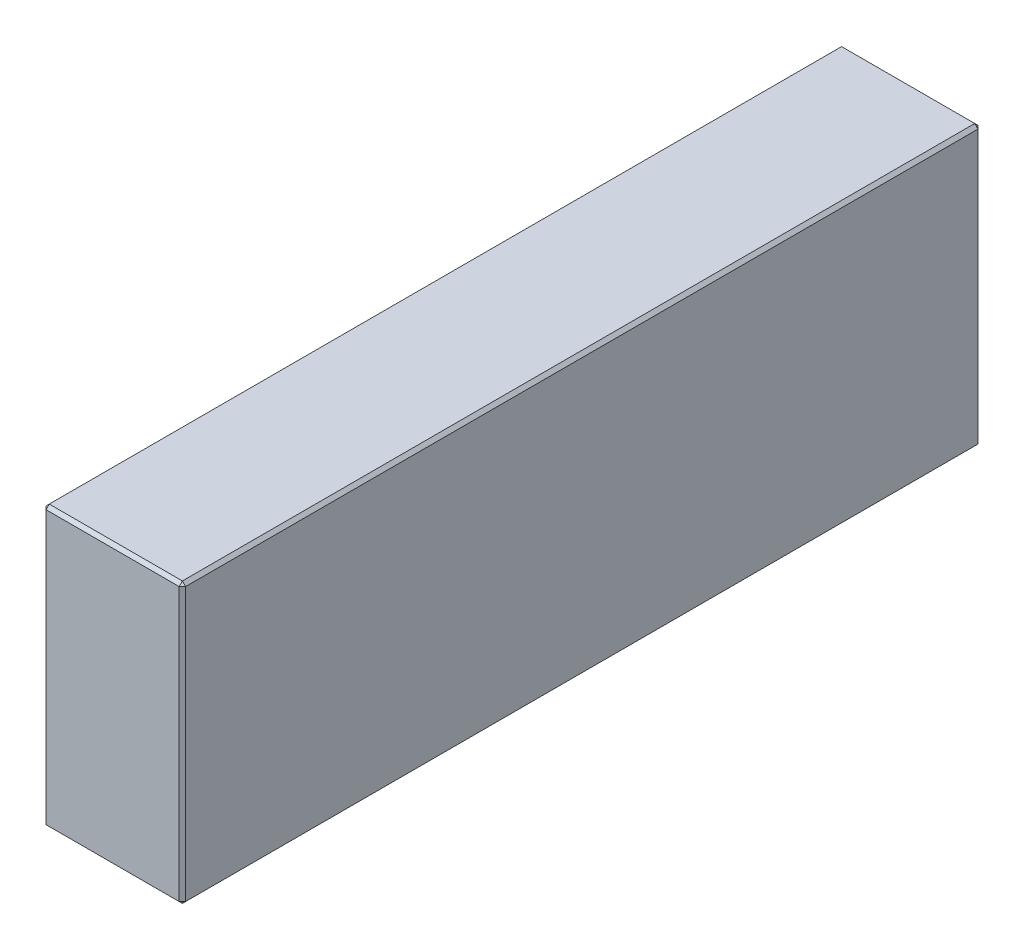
ISO-10303-21;
HEADER;
FILE_DESCRIPTION(('STEP AP214'),'2;1');
FILE_NAME('part.step','',(''),(''),'','','');
FILE_SCHEMA(('AUTOMOTIVE_DESIGN { 1 0 10303 214 1 1 1 1 }'));
ENDSEC;
DATA;
#1=APPLICATION_CONTEXT('core data for automotive mechanical design processes');
#2=APPLICATION_PROTOCOL_DEFINITION('international standard','automotive_design',2000,#1);
#3=PRODUCT_CONTEXT('',#1,'mechanical');
#4=PRODUCT('Part','Part','',(#3));
#5=PRODUCT_RELATED_PRODUCT_CATEGORY('part','',(#4));
#6=PRODUCT_DEFINITION_FORMATION('','',#4);
#7=PRODUCT_DEFINITION_CONTEXT('part definition',#1,'design');
#8=PRODUCT_DEFINITION('design','',#6,#7);
#9=PRODUCT_DEFINITION_SHAPE('','',#8);
#10=(LENGTH_UNIT() NAMED_UNIT(*) SI_UNIT(.MILLI.,.METRE.));
#11=(NAMED_UNIT(*) PLANE_ANGLE_UNIT() SI_UNIT($,.RADIAN.));
#12=(NAMED_UNIT(*) SI_UNIT($,.STERADIAN.) SOLID_ANGLE_UNIT());
#13=UNCERTAINTY_MEASURE_WITH_UNIT(LENGTH_MEASURE(1.E-05),#10,'distance_accuracy_value','');
#14=(GEOMETRIC_REPRESENTATION_CONTEXT(3) GLOBAL_UNCERTAINTY_ASSIGNED_CONTEXT((#13)) GLOBAL_UNIT_ASSIGNED_CONTEXT((#10,
#11,#12)) REPRESENTATION_CONTEXT('',''));
#15=CARTESIAN_POINT('',(0.,0.,0.));
#16=DIRECTION('',(0.,0.,1.));
#17=DIRECTION('',(1.,0.,0.));
#18=AXIS2_PLACEMENT_3D('',#15,#16,#17);
#19=CARTESIAN_POINT('',(-21.5,86.,123.));
#20=DIRECTION('',(1.,0.,0.));
#21=DIRECTION('',(0.,0.,-1.));
#22=AXIS2_PLACEMENT_3D('',#19,#20,#21);
#23=PLANE('',#22);
#24=DIRECTION('',(0.,-1.,0.));
#25=VECTOR('',#24,1.);
#26=CARTESIAN_POINT('',(-21.5,86.,-122.));
#27=LINE('',#26,#25);
#28=CARTESIAN_POINT('',(-21.5,85.,-122.));
#29=VERTEX_POINT('',#28);
#30=CARTESIAN_POINT('',(-21.5,1.,-122.));
#31=VERTEX_POINT('',#30);
#32=EDGE_CURVE('E115',#29,#31,#27,.T.);
#33=ORIENTED_EDGE('',*,*,#32,.T.);
#34=DIRECTION('',(0.,0.,1.));
#35=VECTOR('',#34,1.);
#36=CARTESIAN_POINT('',(-21.5,1.,123.));
#37=LINE('',#36,#35);
#38=CARTESIAN_POINT('',(-21.5,1.,122.));
#39=VERTEX_POINT('',#38);
#40=EDGE_CURVE('E111',#31,#39,#37,.T.);
#41=ORIENTED_EDGE('',*,*,#40,.T.);
#42=DIRECTION('',(0.,1.,0.));
#43=VECTOR('',#42,1.);
#44=CARTESIAN_POINT('',(-21.5,86.,122.));
#45=LINE('',#44,#43);
#46=CARTESIAN_POINT('',(-21.5,85.,122.));
#47=VERTEX_POINT('',#46);
#48=EDGE_CURVE('E104',#39,#47,#45,.T.);
#49=ORIENTED_EDGE('',*,*,#48,.T.);
#50=DIRECTION('',(0.,0.,-1.));
#51=VECTOR('',#50,1.);
#52=CARTESIAN_POINT('',(-21.5,85.,-123.));
#53=LINE('',#52,#51);
#54=EDGE_CURVE('E108',#47,#29,#53,.T.);
#55=ORIENTED_EDGE('',*,*,#54,.T.);
#56=EDGE_LOOP('',(#33,#41,#49,#55));
#57=FACE_BOUND('',#56,.T.);
#58=ADVANCED_FACE('F16',(#57),#23,.F.);
#59=CARTESIAN_POINT('',(21.5,86.,123.));
#60=DIRECTION('',(0.,0.,-1.));
#61=DIRECTION('',(-1.,0.,0.));
#62=AXIS2_PLACEMENT_3D('',#59,#60,#61);
#63=PLANE('',#62);
#64=DIRECTION('',(-1.,0.,0.));
#65=VECTOR('',#64,1.);
#66=CARTESIAN_POINT('',(-21.5,85.,123.));
#67=LINE('',#66,#65);
#68=CARTESIAN_POINT('',(20.5,85.,123.));
#69=VERTEX_POINT('',#68);
#70=CARTESIAN_POINT('',(-20.5,85.,123.));
#71=VERTEX_POINT('',#70);
#72=EDGE_CURVE('E165',#69,#71,#67,.T.);
#73=ORIENTED_EDGE('',*,*,#72,.T.);
#74=DIRECTION('',(0.,-1.,0.));
#75=VECTOR('',#74,1.);
#76=CARTESIAN_POINT('',(-20.5,86.,123.));
#77=LINE('',#76,#75);
#78=CARTESIAN_POINT('',(-20.5,0.999999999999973,123.));
#79=VERTEX_POINT('',#78);
#80=EDGE_CURVE('E123',#71,#79,#77,.T.);
#81=ORIENTED_EDGE('',*,*,#80,.T.);
#82=DIRECTION('',(1.,0.,0.));
#83=VECTOR('',#82,1.);
#84=CARTESIAN_POINT('',(21.5,0.999999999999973,123.));
#85=LINE('',#84,#83);
#86=CARTESIAN_POINT('',(20.5,0.999999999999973,123.));
#87=VERTEX_POINT('',#86);
#88=EDGE_CURVE('E169',#79,#87,#85,.T.);
#89=ORIENTED_EDGE('',*,*,#88,.T.);
#90=DIRECTION('',(0.,1.,0.));
#91=VECTOR('',#90,1.);
#92=CARTESIAN_POINT('',(20.5,86.,123.));
#93=LINE('',#92,#91);
#94=EDGE_CURVE('E167',#87,#69,#93,.T.);
#95=ORIENTED_EDGE('',*,*,#94,.T.);
#96=EDGE_LOOP('',(#73,#81,#89,#95));
#97=FACE_BOUND('',#96,.T.);
#98=ADVANCED_FACE('F276',(#97),#63,.F.);
#99=CARTESIAN_POINT('',(21.5,86.,123.));
#100=DIRECTION('',(-1.,0.,0.));
#101=DIRECTION('',(0.,0.,1.));
#102=AXIS2_PLACEMENT_3D('',#99,#100,#101);
#103=PLANE('',#102);
#104=DIRECTION('',(0.,0.,-1.));
#105=VECTOR('',#104,1.);
#106=CARTESIAN_POINT('',(21.5,0.999999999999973,123.));
#107=LINE('',#106,#105);
#108=CARTESIAN_POINT('',(21.5,0.999999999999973,122.));
#109=VERTEX_POINT('',#108);
#110=CARTESIAN_POINT('',(21.5,0.999999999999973,-122.));
#111=VERTEX_POINT('',#110);
#112=EDGE_CURVE('E160',#109,#111,#107,.T.);
#113=ORIENTED_EDGE('',*,*,#112,.T.);
#114=DIRECTION('',(0.,1.,0.));
#115=VECTOR('',#114,1.);
#116=CARTESIAN_POINT('',(21.5,86.,-122.));
#117=LINE('',#116,#115);
#118=CARTESIAN_POINT('',(21.5,85.,-122.));
#119=VERTEX_POINT('',#118);
#120=EDGE_CURVE('E162',#111,#119,#117,.T.);
#121=ORIENTED_EDGE('',*,*,#120,.T.);
#122=DIRECTION('',(0.,0.,1.));
#123=VECTOR('',#122,1.);
#124=CARTESIAN_POINT('',(21.5,85.,123.));
#125=LINE('',#124,#123);
#126=CARTESIAN_POINT('',(21.5,85.,122.));
#127=VERTEX_POINT('',#126);
#128=EDGE_CURVE('E156',#119,#127,#125,.T.);
#129=ORIENTED_EDGE('',*,*,#128,.T.);
#130=DIRECTION('',(0.,-1.,0.));
#131=VECTOR('',#130,1.);
#132=CARTESIAN_POINT('',(21.5,86.,122.));
#133=LINE('',#132,#131);
#134=EDGE_CURVE('E158',#127,#109,#133,.T.);
#135=ORIENTED_EDGE('',*,*,#134,.T.);
#136=EDGE_LOOP('',(#113,#121,#129,#135));
#137=FACE_BOUND('',#136,.T.);
#138=ADVANCED_FACE('F255',(#137),#103,.F.);
#139=CARTESIAN_POINT('',(21.5,86.,-123.));
#140=DIRECTION('',(0.,0.,1.));
#141=DIRECTION('',(1.,0.,0.));
#142=AXIS2_PLACEMENT_3D('',#139,#140,#141);
#143=PLANE('',#142);
#144=DIRECTION('',(0.,-1.,0.));
#145=VECTOR('',#144,1.);
#146=CARTESIAN_POINT('',(20.5,86.,-123.));
#147=LINE('',#146,#145);
#148=CARTESIAN_POINT('',(20.5,85.,-123.));
#149=VERTEX_POINT('',#148);
#150=CARTESIAN_POINT('',(20.5,0.999999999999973,-123.));
#151=VERTEX_POINT('',#150);
#152=EDGE_CURVE('E149',#149,#151,#147,.T.);
#153=ORIENTED_EDGE('',*,*,#152,.T.);
#154=DIRECTION('',(-1.,0.,0.));
#155=VECTOR('',#154,1.);
#156=CARTESIAN_POINT('',(21.5,0.999999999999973,-123.));
#157=LINE('',#156,#155);
#158=CARTESIAN_POINT('',(-20.5,0.999999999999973,-123.));
#159=VERTEX_POINT('',#158);
#160=EDGE_CURVE('E154',#151,#159,#157,.T.);
#161=ORIENTED_EDGE('',*,*,#160,.T.);
#162=DIRECTION('',(0.,1.,0.));
#163=VECTOR('',#162,1.);
#164=CARTESIAN_POINT('',(-20.5,86.,-123.));
#165=LINE('',#164,#163);
#166=CARTESIAN_POINT('',(-20.5,85.,-123.));
#167=VERTEX_POINT('',#166);
#168=EDGE_CURVE('E151',#159,#167,#165,.T.);
#169=ORIENTED_EDGE('',*,*,#168,.T.);
#170=DIRECTION('',(1.,0.,0.));
#171=VECTOR('',#170,1.);
#172=CARTESIAN_POINT('',(21.5,85.,-123.));
#173=LINE('',#172,#171);
#174=EDGE_CURVE('E147',#167,#149,#173,.T.);
#175=ORIENTED_EDGE('',*,*,#174,.T.);
#176=EDGE_LOOP('',(#153,#161,#169,#175));
#177=FACE_BOUND('',#176,.T.);
#178=ADVANCED_FACE('F285',(#177),#143,.F.);
#179=CARTESIAN_POINT('',(0.,86.,0.));
#180=DIRECTION('',(0.,1.,0.));
#181=DIRECTION('',(0.,0.,1.));
#182=AXIS2_PLACEMENT_3D('',#179,#180,#181);
#183=PLANE('',#182);
#184=DIRECTION('',(0.,0.,-1.));
#185=VECTOR('',#184,1.);
#186=CARTESIAN_POINT('',(20.5,86.,-123.));
#187=LINE('',#186,#185);
#188=CARTESIAN_POINT('',(20.5,86.,122.));
#189=VERTEX_POINT('',#188);
#190=CARTESIAN_POINT('',(20.5,86.,-122.));
#191=VERTEX_POINT('',#190);
#192=EDGE_CURVE('E25',#189,#191,#187,.T.);
#193=ORIENTED_EDGE('',*,*,#192,.T.);
#194=DIRECTION('',(-1.,0.,0.));
#195=VECTOR('',#194,1.);
#196=CARTESIAN_POINT('',(-21.5,86.,-122.));
#197=LINE('',#196,#195);
#198=CARTESIAN_POINT('',(-20.5,86.,-122.));
#199=VERTEX_POINT('',#198);
#200=EDGE_CURVE('E10',#191,#199,#197,.T.);
#201=ORIENTED_EDGE('',*,*,#200,.T.);
#202=DIRECTION('',(0.,0.,1.));
#203=VECTOR('',#202,1.);
#204=CARTESIAN_POINT('',(-20.5,86.,123.));
#205=LINE('',#204,#203);
#206=CARTESIAN_POINT('',(-20.5,86.,122.));
#207=VERTEX_POINT('',#206);
#208=EDGE_CURVE('E181',#199,#207,#205,.T.);
#209=ORIENTED_EDGE('',*,*,#208,.T.);
#210=DIRECTION('',(1.,0.,0.));
#211=VECTOR('',#210,1.);
#212=CARTESIAN_POINT('',(21.5,86.,122.));
#213=LINE('',#212,#211);
#214=EDGE_CURVE('E36',#207,#189,#213,.T.);
#215=ORIENTED_EDGE('',*,*,#214,.T.);
#216=EDGE_LOOP('',(#193,#201,#209,#215));
#217=FACE_BOUND('',#216,.T.);
#218=ADVANCED_FACE('F351',(#217),#183,.T.);
#219=CARTESIAN_POINT('',(0.,0.,0.));
#220=DIRECTION('',(0.,1.,0.));
#221=DIRECTION('',(0.,0.,1.));
#222=AXIS2_PLACEMENT_3D('',#219,#220,#221);
#223=PLANE('',#222);
#224=DIRECTION('',(0.,0.,1.));
#225=VECTOR('',#224,1.);
#226=CARTESIAN_POINT('',(20.5,0.,0.));
#227=LINE('',#226,#225);
#228=CARTESIAN_POINT('',(20.5,0.,-122.));
#229=VERTEX_POINT('',#228);
#230=CARTESIAN_POINT('',(20.5,0.,122.));
#231=VERTEX_POINT('',#230);
#232=EDGE_CURVE('E172',#229,#231,#227,.T.);
#233=ORIENTED_EDGE('',*,*,#232,.T.);
#234=DIRECTION('',(-1.,0.,0.));
#235=VECTOR('',#234,1.);
#236=CARTESIAN_POINT('',(0.,0.,122.));
#237=LINE('',#236,#235);
#238=CARTESIAN_POINT('',(-20.5,0.,122.));
#239=VERTEX_POINT('',#238);
#240=EDGE_CURVE('E178',#231,#239,#237,.T.);
#241=ORIENTED_EDGE('',*,*,#240,.T.);
#242=DIRECTION('',(0.,0.,-1.));
#243=VECTOR('',#242,1.);
#244=CARTESIAN_POINT('',(-20.5,0.,0.));
#245=LINE('',#244,#243);
#246=CARTESIAN_POINT('',(-20.5,0.,-122.));
#247=VERTEX_POINT('',#246);
#248=EDGE_CURVE('E176',#239,#247,#245,.T.);
#249=ORIENTED_EDGE('',*,*,#248,.T.);
#250=DIRECTION('',(1.,0.,0.));
#251=VECTOR('',#250,1.);
#252=CARTESIAN_POINT('',(0.,0.,-122.));
#253=LINE('',#252,#251);
#254=EDGE_CURVE('E174',#247,#229,#253,.T.);
#255=ORIENTED_EDGE('',*,*,#254,.T.);
#256=EDGE_LOOP('',(#233,#241,#249,#255));
#257=FACE_BOUND('',#256,.T.);
#258=ADVANCED_FACE('F247',(#257),#223,.F.);
#259=CARTESIAN_POINT('',(21.5,86.,122.));
#260=DIRECTION('',(-0.707106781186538,0.,-0.707106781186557));
#261=DIRECTION('',(0.,-1.,0.));
#262=AXIS2_PLACEMENT_3D('',#259,#260,#261);
#263=PLANE('',#262);
#264=DIRECTION('',(-0.707106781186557,0.,0.707106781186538));
#265=VECTOR('',#264,1.);
#266=CARTESIAN_POINT('',(20.5,85.,123.));
#267=LINE('',#266,#265);
#268=EDGE_CURVE('E20',#69,#127,#267,.F.);
#269=ORIENTED_EDGE('',*,*,#268,.F.);
#270=ORIENTED_EDGE('',*,*,#94,.F.);
#271=DIRECTION('',(0.707106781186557,0.,-0.707106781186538));
#272=VECTOR('',#271,1.);
#273=CARTESIAN_POINT('',(20.5,0.999999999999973,123.));
#274=LINE('',#273,#272);
#275=EDGE_CURVE('E143',#109,#87,#274,.F.);
#276=ORIENTED_EDGE('',*,*,#275,.F.);
#277=ORIENTED_EDGE('',*,*,#134,.F.);
#278=EDGE_LOOP('',(#269,#270,#276,#277));
#279=FACE_BOUND('',#278,.T.);
#280=ADVANCED_FACE('F18',(#279),#263,.F.);
#281=CARTESIAN_POINT('',(20.5,85.,123.));
#282=DIRECTION('',(0.577350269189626,0.57735026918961,0.577350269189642));
#283=DIRECTION('',(0.707106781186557,0.,-0.707106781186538));
#284=AXIS2_PLACEMENT_3D('',#281,#282,#283);
#285=PLANE('',#284);
#286=DIRECTION('',(0.,-0.707106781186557,0.707106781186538));
#287=VECTOR('',#286,1.);
#288=CARTESIAN_POINT('',(20.5,85.,123.));
#289=LINE('',#288,#287);
#290=EDGE_CURVE('E227',#69,#189,#289,.F.);
#291=ORIENTED_EDGE('',*,*,#290,.F.);
#292=ORIENTED_EDGE('',*,*,#268,.T.);
#293=DIRECTION('',(-0.707106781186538,0.707106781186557,0.));
#294=VECTOR('',#293,1.);
#295=CARTESIAN_POINT('',(21.,85.5,122.));
#296=LINE('',#295,#294);
#297=EDGE_CURVE('E229',#189,#127,#296,.F.);
#298=ORIENTED_EDGE('',*,*,#297,.F.);
#299=EDGE_LOOP('',(#291,#292,#298));
#300=FACE_BOUND('',#299,.T.);
#301=ADVANCED_FACE('F271',(#300),#285,.T.);
#302=CARTESIAN_POINT('',(20.5,0.999999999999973,123.));
#303=DIRECTION('',(0.57735026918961,-0.577350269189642,0.577350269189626));
#304=DIRECTION('',(0.,-0.707106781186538,-0.707106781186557));
#305=AXIS2_PLACEMENT_3D('',#302,#303,#304);
#306=PLANE('',#305);
#307=DIRECTION('',(-0.707106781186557,-0.707106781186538,0.));
#308=VECTOR('',#307,1.);
#309=CARTESIAN_POINT('',(21.,0.499999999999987,122.));
#310=LINE('',#309,#308);
#311=EDGE_CURVE('E221',#109,#231,#310,.T.);
#312=ORIENTED_EDGE('',*,*,#311,.F.);
#313=ORIENTED_EDGE('',*,*,#275,.T.);
#314=DIRECTION('',(0.,0.707106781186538,0.707106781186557));
#315=VECTOR('',#314,1.);
#316=CARTESIAN_POINT('',(20.5,0.999999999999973,123.));
#317=LINE('',#316,#315);
#318=EDGE_CURVE('E224',#231,#87,#317,.T.);
#319=ORIENTED_EDGE('',*,*,#318,.F.);
#320=EDGE_LOOP('',(#312,#313,#319));
#321=FACE_BOUND('',#320,.T.);
#322=ADVANCED_FACE('F236',(#321),#306,.T.);
#323=CARTESIAN_POINT('',(20.5,86.,0.));
#324=DIRECTION('',(0.707106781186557,0.707106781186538,0.));
#325=DIRECTION('',(0.,0.,1.));
#326=AXIS2_PLACEMENT_3D('',#323,#324,#325);
#327=PLANE('',#326);
#328=ORIENTED_EDGE('',*,*,#297,.T.);
#329=ORIENTED_EDGE('',*,*,#128,.F.);
#330=DIRECTION('',(0.707106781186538,-0.707106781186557,0.));
#331=VECTOR('',#330,1.);
#332=CARTESIAN_POINT('',(21.5,85.,-122.));
#333=LINE('',#332,#331);
#334=EDGE_CURVE('E216',#191,#119,#333,.T.);
#335=ORIENTED_EDGE('',*,*,#334,.F.);
#336=ORIENTED_EDGE('',*,*,#192,.F.);
#337=EDGE_LOOP('',(#328,#329,#335,#336));
#338=FACE_BOUND('',#337,.T.);
#339=ADVANCED_FACE('F266',(#338),#327,.T.);
#340=CARTESIAN_POINT('',(0.,86.,122.));
#341=DIRECTION('',(0.,0.707106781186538,0.707106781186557));
#342=DIRECTION('',(-1.,0.,0.));
#343=AXIS2_PLACEMENT_3D('',#340,#341,#342);
#344=PLANE('',#343);
#345=ORIENTED_EDGE('',*,*,#290,.T.);
#346=ORIENTED_EDGE('',*,*,#214,.F.);
#347=DIRECTION('',(0.,0.707106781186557,-0.707106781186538));
#348=VECTOR('',#347,1.);
#349=CARTESIAN_POINT('',(-20.5,85.5,122.5));
#350=LINE('',#349,#348);
#351=EDGE_CURVE('E127',#71,#207,#350,.T.);
#352=ORIENTED_EDGE('',*,*,#351,.F.);
#353=ORIENTED_EDGE('',*,*,#72,.F.);
#354=EDGE_LOOP('',(#345,#346,#352,#353));
#355=FACE_BOUND('',#354,.T.);
#356=ADVANCED_FACE('F274',(#355),#344,.T.);
#357=CARTESIAN_POINT('',(-20.5,86.,123.));
#358=DIRECTION('',(0.707106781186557,0.,-0.707106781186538));
#359=DIRECTION('',(0.,-1.,0.));
#360=AXIS2_PLACEMENT_3D('',#357,#358,#359);
#361=PLANE('',#360);
#362=DIRECTION('',(0.707106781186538,0.,0.707106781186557));
#363=VECTOR('',#362,1.);
#364=CARTESIAN_POINT('',(-20.5,0.999999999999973,123.));
#365=LINE('',#364,#363);
#366=EDGE_CURVE('E128',#79,#39,#365,.F.);
#367=ORIENTED_EDGE('',*,*,#366,.F.);
#368=ORIENTED_EDGE('',*,*,#80,.F.);
#369=DIRECTION('',(-0.707106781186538,0.,-0.707106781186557));
#370=VECTOR('',#369,1.);
#371=CARTESIAN_POINT('',(-21.5,85.,122.));
#372=LINE('',#371,#370);
#373=EDGE_CURVE('E119',#47,#71,#372,.F.);
#374=ORIENTED_EDGE('',*,*,#373,.F.);
#375=ORIENTED_EDGE('',*,*,#48,.F.);
#376=EDGE_LOOP('',(#367,#368,#374,#375));
#377=FACE_BOUND('',#376,.T.);
#378=ADVANCED_FACE('F121',(#377),#361,.F.);
#379=CARTESIAN_POINT('',(21.5,0.999999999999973,123.));
#380=DIRECTION('',(0.,0.707106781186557,-0.707106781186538));
#381=DIRECTION('',(1.,0.,0.));
#382=AXIS2_PLACEMENT_3D('',#379,#380,#381);
#383=PLANE('',#382);
#384=ORIENTED_EDGE('',*,*,#318,.T.);
#385=ORIENTED_EDGE('',*,*,#88,.F.);
#386=DIRECTION('',(0.,-0.707106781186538,-0.707106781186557));
#387=VECTOR('',#386,1.);
#388=CARTESIAN_POINT('',(-20.5,0.999999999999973,123.));
#389=LINE('',#388,#387);
#390=EDGE_CURVE('E212',#239,#79,#389,.F.);
#391=ORIENTED_EDGE('',*,*,#390,.F.);
#392=ORIENTED_EDGE('',*,*,#240,.F.);
#393=EDGE_LOOP('',(#384,#385,#391,#392));
#394=FACE_BOUND('',#393,.T.);
#395=ADVANCED_FACE('F244',(#394),#383,.F.);
#396=CARTESIAN_POINT('',(21.5,0.999999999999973,123.));
#397=DIRECTION('',(-0.707106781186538,0.707106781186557,0.));
#398=DIRECTION('',(0.,0.,-1.));
#399=AXIS2_PLACEMENT_3D('',#396,#397,#398);
#400=PLANE('',#399);
#401=ORIENTED_EDGE('',*,*,#311,.T.);
#402=ORIENTED_EDGE('',*,*,#232,.F.);
#403=DIRECTION('',(0.707106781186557,0.707106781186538,0.));
#404=VECTOR('',#403,1.);
#405=CARTESIAN_POINT('',(21.,0.499999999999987,-122.));
#406=LINE('',#405,#404);
#407=EDGE_CURVE('E209',#111,#229,#406,.F.);
#408=ORIENTED_EDGE('',*,*,#407,.F.);
#409=ORIENTED_EDGE('',*,*,#112,.F.);
#410=EDGE_LOOP('',(#401,#402,#408,#409));
#411=FACE_BOUND('',#410,.T.);
#412=ADVANCED_FACE('F252',(#411),#400,.F.);
#413=CARTESIAN_POINT('',(20.5,86.,-123.));
#414=DIRECTION('',(-0.707106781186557,0.,0.707106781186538));
#415=DIRECTION('',(0.,-1.,0.));
#416=AXIS2_PLACEMENT_3D('',#413,#414,#415);
#417=PLANE('',#416);
#418=DIRECTION('',(0.707106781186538,0.,0.707106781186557));
#419=VECTOR('',#418,1.);
#420=CARTESIAN_POINT('',(21.5,85.,-122.));
#421=LINE('',#420,#419);
#422=EDGE_CURVE('E218',#119,#149,#421,.F.);
#423=ORIENTED_EDGE('',*,*,#422,.F.);
#424=ORIENTED_EDGE('',*,*,#120,.F.);
#425=DIRECTION('',(-0.707106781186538,0.,-0.707106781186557));
#426=VECTOR('',#425,1.);
#427=CARTESIAN_POINT('',(20.5,0.999999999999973,-123.));
#428=LINE('',#427,#426);
#429=EDGE_CURVE('E206',#151,#111,#428,.F.);
#430=ORIENTED_EDGE('',*,*,#429,.F.);
#431=ORIENTED_EDGE('',*,*,#152,.F.);
#432=EDGE_LOOP('',(#423,#424,#430,#431));
#433=FACE_BOUND('',#432,.T.);
#434=ADVANCED_FACE('F259',(#433),#417,.F.);
#435=CARTESIAN_POINT('',(21.5,85.,-122.));
#436=DIRECTION('',(0.577350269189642,0.57735026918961,-0.577350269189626));
#437=DIRECTION('',(-0.707106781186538,0.,-0.707106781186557));
#438=AXIS2_PLACEMENT_3D('',#435,#436,#437);
#439=PLANE('',#438);
#440=ORIENTED_EDGE('',*,*,#334,.T.);
#441=ORIENTED_EDGE('',*,*,#422,.T.);
#442=DIRECTION('',(0.,0.707106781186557,0.707106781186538));
#443=VECTOR('',#442,1.);
#444=CARTESIAN_POINT('',(20.5,85.5,-122.5));
#445=LINE('',#444,#443);
#446=EDGE_CURVE('E135',#191,#149,#445,.F.);
#447=ORIENTED_EDGE('',*,*,#446,.F.);
#448=EDGE_LOOP('',(#440,#441,#447));
#449=FACE_BOUND('',#448,.T.);
#450=ADVANCED_FACE('F326',(#449),#439,.T.);
#451=CARTESIAN_POINT('',(-21.5,85.,122.));
#452=DIRECTION('',(-0.577350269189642,0.57735026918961,0.577350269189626));
#453=DIRECTION('',(0.707106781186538,0.,0.707106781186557));
#454=AXIS2_PLACEMENT_3D('',#451,#452,#453);
#455=PLANE('',#454);
#456=ORIENTED_EDGE('',*,*,#373,.T.);
#457=ORIENTED_EDGE('',*,*,#351,.T.);
#458=DIRECTION('',(-0.707106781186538,-0.707106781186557,0.));
#459=VECTOR('',#458,1.);
#460=CARTESIAN_POINT('',(-21.5,85.,122.));
#461=LINE('',#460,#459);
#462=EDGE_CURVE('E131',#47,#207,#461,.F.);
#463=ORIENTED_EDGE('',*,*,#462,.F.);
#464=EDGE_LOOP('',(#456,#457,#463));
#465=FACE_BOUND('',#464,.T.);
#466=ADVANCED_FACE('F132',(#465),#455,.T.);
#467=CARTESIAN_POINT('',(-20.5,0.999999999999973,123.));
#468=DIRECTION('',(-0.577350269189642,-0.577350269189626,0.57735026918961));
#469=DIRECTION('',(0.707106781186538,-0.707106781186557,0.));
#470=AXIS2_PLACEMENT_3D('',#467,#468,#469);
#471=PLANE('',#470);
#472=ORIENTED_EDGE('',*,*,#390,.T.);
#473=ORIENTED_EDGE('',*,*,#366,.T.);
#474=DIRECTION('',(-0.707106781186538,0.707106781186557,0.));
#475=VECTOR('',#474,1.);
#476=CARTESIAN_POINT('',(-21.,0.5,122.));
#477=LINE('',#476,#475);
#478=EDGE_CURVE('E136',#239,#39,#477,.T.);
#479=ORIENTED_EDGE('',*,*,#478,.F.);
#480=EDGE_LOOP('',(#472,#473,#479));
#481=FACE_BOUND('',#480,.T.);
#482=ADVANCED_FACE('F319',(#481),#471,.T.);
#483=CARTESIAN_POINT('',(20.5,0.999999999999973,-123.));
#484=DIRECTION('',(0.577350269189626,-0.577350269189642,-0.57735026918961));
#485=DIRECTION('',(0.707106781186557,0.707106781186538,0.));
#486=AXIS2_PLACEMENT_3D('',#483,#484,#485);
#487=PLANE('',#486);
#488=ORIENTED_EDGE('',*,*,#429,.T.);
#489=ORIENTED_EDGE('',*,*,#407,.T.);
#490=DIRECTION('',(0.,-0.707106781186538,0.707106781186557));
#491=VECTOR('',#490,1.);
#492=CARTESIAN_POINT('',(20.5,0.999999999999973,-123.));
#493=LINE('',#492,#491);
#494=EDGE_CURVE('E199',#151,#229,#493,.T.);
#495=ORIENTED_EDGE('',*,*,#494,.F.);
#496=EDGE_LOOP('',(#488,#489,#495));
#497=FACE_BOUND('',#496,.T.);
#498=ADVANCED_FACE('F315',(#497),#487,.T.);
#499=CARTESIAN_POINT('',(0.,86.,-122.));
#500=DIRECTION('',(0.,0.707106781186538,-0.707106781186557));
#501=DIRECTION('',(1.,0.,0.));
#502=AXIS2_PLACEMENT_3D('',#499,#500,#501);
#503=PLANE('',#502);
#504=ORIENTED_EDGE('',*,*,#446,.T.);
#505=ORIENTED_EDGE('',*,*,#174,.F.);
#506=DIRECTION('',(0.,-0.707106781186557,-0.707106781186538));
#507=VECTOR('',#506,1.);
#508=CARTESIAN_POINT('',(-20.5,85.,-123.));
#509=LINE('',#508,#507);
#510=EDGE_CURVE('E196',#199,#167,#509,.T.);
#511=ORIENTED_EDGE('',*,*,#510,.F.);
#512=ORIENTED_EDGE('',*,*,#200,.F.);
#513=EDGE_LOOP('',(#504,#505,#511,#512));
#514=FACE_BOUND('',#513,.T.);
#515=ADVANCED_FACE('F312',(#514),#503,.T.);
#516=CARTESIAN_POINT('',(-20.5,86.,0.));
#517=DIRECTION('',(-0.707106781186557,0.707106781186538,0.));
#518=DIRECTION('',(0.,0.,-1.));
#519=AXIS2_PLACEMENT_3D('',#516,#517,#518);
#520=PLANE('',#519);
#521=ORIENTED_EDGE('',*,*,#462,.T.);
#522=ORIENTED_EDGE('',*,*,#208,.F.);
#523=DIRECTION('',(0.707106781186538,0.707106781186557,0.));
#524=VECTOR('',#523,1.);
#525=CARTESIAN_POINT('',(-21.,85.5,-122.));
#526=LINE('',#525,#524);
#527=EDGE_CURVE('E139',#29,#199,#526,.T.);
#528=ORIENTED_EDGE('',*,*,#527,.F.);
#529=ORIENTED_EDGE('',*,*,#54,.F.);
#530=EDGE_LOOP('',(#521,#522,#528,#529));
#531=FACE_BOUND('',#530,.T.);
#532=ADVANCED_FACE('F138',(#531),#520,.T.);
#533=CARTESIAN_POINT('',(-21.5,1.,123.));
#534=DIRECTION('',(0.707106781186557,0.707106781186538,0.));
#535=DIRECTION('',(0.,0.,1.));
#536=AXIS2_PLACEMENT_3D('',#533,#534,#535);
#537=PLANE('',#536);
#538=ORIENTED_EDGE('',*,*,#478,.T.);
#539=ORIENTED_EDGE('',*,*,#40,.F.);
#540=DIRECTION('',(0.707106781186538,-0.707106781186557,0.));
#541=VECTOR('',#540,1.);
#542=CARTESIAN_POINT('',(-21.5,1.,-122.));
#543=LINE('',#542,#541);
#544=EDGE_CURVE('E192',#247,#31,#543,.F.);
#545=ORIENTED_EDGE('',*,*,#544,.F.);
#546=ORIENTED_EDGE('',*,*,#248,.F.);
#547=EDGE_LOOP('',(#538,#539,#545,#546));
#548=FACE_BOUND('',#547,.T.);
#549=ADVANCED_FACE('F305',(#548),#537,.F.);
#550=CARTESIAN_POINT('',(21.5,0.999999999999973,-123.));
#551=DIRECTION('',(0.,0.707106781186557,0.707106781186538));
#552=DIRECTION('',(-1.,0.,0.));
#553=AXIS2_PLACEMENT_3D('',#550,#551,#552);
#554=PLANE('',#553);
#555=ORIENTED_EDGE('',*,*,#494,.T.);
#556=ORIENTED_EDGE('',*,*,#254,.F.);
#557=DIRECTION('',(0.,0.707106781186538,-0.707106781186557));
#558=VECTOR('',#557,1.);
#559=CARTESIAN_POINT('',(-20.5,0.499999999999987,-122.5));
#560=LINE('',#559,#558);
#561=EDGE_CURVE('E189',#159,#247,#560,.F.);
#562=ORIENTED_EDGE('',*,*,#561,.F.);
#563=ORIENTED_EDGE('',*,*,#160,.F.);
#564=EDGE_LOOP('',(#555,#556,#562,#563));
#565=FACE_BOUND('',#564,.T.);
#566=ADVANCED_FACE('F301',(#565),#554,.F.);
#567=CARTESIAN_POINT('',(-20.5,85.,-123.));
#568=DIRECTION('',(-0.577350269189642,0.57735026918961,-0.577350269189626));
#569=DIRECTION('',(-0.707106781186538,0.,0.707106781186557));
#570=AXIS2_PLACEMENT_3D('',#567,#568,#569);
#571=PLANE('',#570);
#572=ORIENTED_EDGE('',*,*,#527,.T.);
#573=ORIENTED_EDGE('',*,*,#510,.T.);
#574=DIRECTION('',(0.707106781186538,0.,-0.707106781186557));
#575=VECTOR('',#574,1.);
#576=CARTESIAN_POINT('',(-20.5,85.,-123.));
#577=LINE('',#576,#575);
#578=EDGE_CURVE('E187',#29,#167,#577,.T.);
#579=ORIENTED_EDGE('',*,*,#578,.F.);
#580=EDGE_LOOP('',(#572,#573,#579));
#581=FACE_BOUND('',#580,.T.);
#582=ADVANCED_FACE('F297',(#581),#571,.T.);
#583=CARTESIAN_POINT('',(-21.5,1.,-122.));
#584=DIRECTION('',(-0.577350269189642,-0.577350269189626,-0.57735026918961));
#585=DIRECTION('',(0.707106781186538,-0.707106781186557,0.));
#586=AXIS2_PLACEMENT_3D('',#583,#584,#585);
#587=PLANE('',#586);
#588=ORIENTED_EDGE('',*,*,#561,.T.);
#589=ORIENTED_EDGE('',*,*,#544,.T.);
#590=DIRECTION('',(-0.707106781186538,0.,0.707106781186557));
#591=VECTOR('',#590,1.);
#592=CARTESIAN_POINT('',(-21.5,1.,-122.));
#593=LINE('',#592,#591);
#594=EDGE_CURVE('E185',#159,#31,#593,.T.);
#595=ORIENTED_EDGE('',*,*,#594,.F.);
#596=EDGE_LOOP('',(#588,#589,#595));
#597=FACE_BOUND('',#596,.T.);
#598=ADVANCED_FACE('F293',(#597),#587,.T.);
#599=CARTESIAN_POINT('',(-21.5,86.,-122.));
#600=DIRECTION('',(0.707106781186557,0.,0.707106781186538));
#601=DIRECTION('',(0.,-1.,0.));
#602=AXIS2_PLACEMENT_3D('',#599,#600,#601);
#603=PLANE('',#602);
#604=ORIENTED_EDGE('',*,*,#578,.T.);
#605=ORIENTED_EDGE('',*,*,#168,.F.);
#606=ORIENTED_EDGE('',*,*,#594,.T.);
#607=ORIENTED_EDGE('',*,*,#32,.F.);
#608=EDGE_LOOP('',(#604,#605,#606,#607));
#609=FACE_BOUND('',#608,.T.);
#610=ADVANCED_FACE('F290',(#609),#603,.F.);
#611=CLOSED_SHELL('',(#58,#98,#138,#178,#218,#258,#280,#301,#322,#339,#356,#378,#395,#412,#434,
#450,#466,#482,#498,#515,#532,#549,#566,#582,#598,#610));
#612=MANIFOLD_SOLID_BREP('B1',#611);
#613=ADVANCED_BREP_SHAPE_REPRESENTATION('',(#18,#612),#14);
#614=SHAPE_DEFINITION_REPRESENTATION(#9,#613);
ENDSEC;
END-ISO-10303-21;
